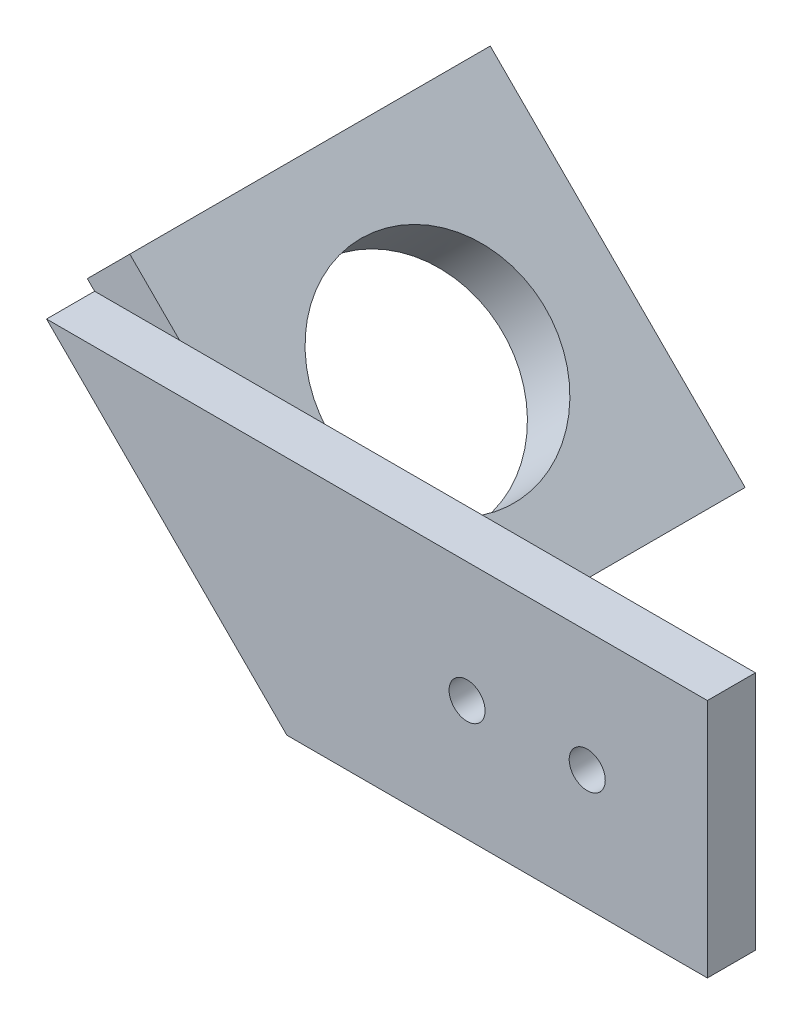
from build123d import *

# Parameters (mm, degrees)
SKETCH_1_W               = 80
SKETCH_1_H               = 20
EXTRUDE_1_DEPTH          = 4
EXTRUDE_2_DEPTH          = 30
SKETCH_3_R               = 9
CUT_EXTRUDE_1_DEPTH      = 20
SKETCH_4_R               = 1.5
CUT_EXTRUDE_2_DEPTH      = 20
CUT_EXTRUDE_3_DEPTH      = 10
CUT_EXTRUDE_5_DEPTH      = 42
CUT_EXTRUDE_5_DEPTH_BACK = 42
SKETCH_7_W               = 80
SKETCH_7_H               = 35.202497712
CUT_EXTRUDE_6_DEPTH      = 42


with BuildPart() as part:
    # Sketch 1 → Extrude 1 (new body)
    with BuildSketch(Plane.XY):
        Rectangle(SKETCH_1_W, SKETCH_1_H)
    extrude_1 = extrude(amount=EXTRUDE_1_DEPTH)

    # Sketch 2 → Extrude 2 (add)
    with BuildSketch(Plane.XY.offset(4)):
        Polygon((-15.606601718, 10.606601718), (5.606601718, -10.606601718), (9.142135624, -7.071067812), (-12.071067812, 14.142135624), align=None)
    extrude_2 = extrude(amount=EXTRUDE_2_DEPTH)

    # Sketch 3 → Cut-Extrude 1 (cut)
    with BuildSketch(Plane(origin=(1.035533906, 1.035533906, 0), x_dir=(0, 0, -1), z_dir=(0.7071067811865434, 0.7071067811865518, 0))):
        with Locations(Location((-19, 3.535533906, 0), (0, 0, 90))):
            Circle(SKETCH_3_R)
    cut_extrude_1 = extrude(amount=-CUT_EXTRUDE_1_DEPTH, mode=Mode.SUBTRACT)

    # Sketch 4 → Cut-Extrude 2 (cut)
    with BuildSketch(Plane.XY.offset(4)):
        with Locations((30, 0)):
            Circle(SKETCH_4_R)
        with Locations((20, 0)):
            Circle(SKETCH_4_R)
    cut_extrude_2 = extrude(amount=-CUT_EXTRUDE_2_DEPTH, mode=Mode.SUBTRACT)

    # Sketch 5 → Cut-Extrude 3 (cut)
    with BuildSketch(Plane.XY.offset(4)):
        Polygon((0, -5), (14.616197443, -19.616197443), (-46.670492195, -16.230640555), (-45.093479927, 12.317059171), (-15.606601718, 10.606601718), align=None)
    extrude(amount=-CUT_EXTRUDE_3_DEPTH, mode=Mode.SUBTRACT)

    # Mirror 2: Extrude 1, Extrude 2, Cut-Extrude 1, Cut-Extrude 2 across plane
    add(extrude_1.mirror(Plane.XY))
    add(extrude_2.mirror(Plane.XY))
    add(cut_extrude_1.mirror(Plane.XY), mode=Mode.SUBTRACT)
    add(cut_extrude_2.mirror(Plane.XY), mode=Mode.SUBTRACT)

    # Sketch 7 → Cut-Extrude 5 (cut, two sides: drawn at the far end of the back side and taken through both)
    with BuildSketch(Plane(origin=(0, 10, 0), x_dir=(1, 0, 0), z_dir=(0, 1, 0)).offset(-CUT_EXTRUDE_5_DEPTH_BACK)):
        with Locations((0, -17.601248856)):
            Rectangle(SKETCH_7_W, SKETCH_7_H)
    extrude(amount=CUT_EXTRUDE_5_DEPTH + CUT_EXTRUDE_5_DEPTH_BACK, mode=Mode.SUBTRACT)

    # Sketch 8 → Cut-Extrude 6 (cut)
    with BuildSketch(Plane(origin=(0, 0, -4), x_dir=(-1, 0, 0), z_dir=(0, 0, -1))):
        Polygon((40, -10), (40, 10), (15, 10), (-5, -10), align=None)
    extrude(amount=-CUT_EXTRUDE_6_DEPTH, mode=Mode.SUBTRACT)


solid = part.part
